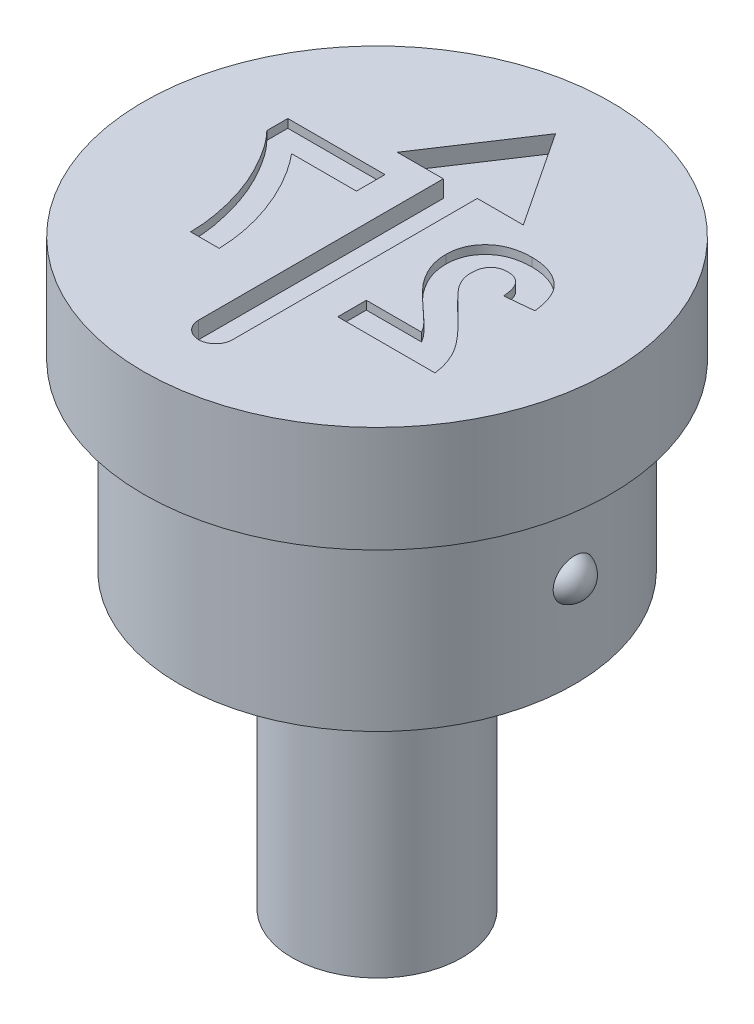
from build123d import *

# Parameters (mm, degrees)
CUT_EXTRUDE1_DEPTH = 0.4
CUT_EXTRUDE2_DEPTH = 0.2


with BuildPart() as part:
    # Sketch1 → Revolve1 (revolve)
    with BuildSketch(Plane.XY, mode=Mode.PRIVATE) as revolve1_sk:
        Polygon((0, 0), (-5.5, 0), (-5.5, -2.5), (-4.65, -2.5), (-4.65, -6.8), (-2, -6.8), (-2, -13.7), (0, -13.7), align=None)
    revolve(revolve1_sk.sketch.rotate(Axis((0, 0, 0), (0, -1, 0)), 270), axis=Axis((0, 0, 0), (0, -1, 0)))

    # Sketch3 → Cut-Extrude1 (cut)
    with BuildSketch(Plane(origin=(0, 0, 0), x_dir=(1, 0, 0), z_dir=(0, 1, 0))):
        with BuildLine():
            Line((0, 4.2), (-1.482623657, 1.96))
            Line((-1.482623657, 1.96), (-0.4, 1.96))
            Line((-0.4, 1.96), (-0.4, -3.8))
            ThreePointArc((-0.4, -3.8), (0, -4.2), (0.4, -3.8))
            Line((0.4, -3.8), (0.4, 1.96))
            Line((0.4, 1.96), (1.482623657, 1.96))
            Line((1.482623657, 1.96), (0, 4.2))
        make_face()
    extrude(amount=-CUT_EXTRUDE1_DEPTH, mode=Mode.SUBTRACT)

    # Sketch4 → Cut-Extrude2 (cut)
    with BuildSketch(Plane(origin=(0, 0, 0), x_dir=(1, 0, 0), z_dir=(0, 1, 0))):
        with BuildLine():
            Line((1.170081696, -1.422594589), (1.170081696, -2.095671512))
            Line((1.170081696, -2.095671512), (3.458543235, -2.095671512))
            add(Edge.make_bspline(
                [(3.458543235, -2.095671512), (3.450795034, -2.038147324), (3.435302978, -1.923131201), (3.387407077, -1.755121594), (3.323482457, -1.591172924), (3.254104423, -1.457758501), (3.185100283, -1.350364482), (3.122492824, -1.262364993), (3.047804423, -1.168737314), (2.962118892, -1.068725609), (2.865909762, -0.962017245), (2.758459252, -0.849008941), (2.639254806, -0.730241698), (2.555392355, -0.649592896), (2.512028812, -0.607891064)],
                knots=[0, 0, 0, 0, 1.156289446, 2.311930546, 3.473459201, 4.661751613, 5.303057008, 6.018253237, 6.81459331, 7.690699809, 8.644447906, 9.679642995, 10.800191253, 12, 12, 12, 12], degree=3))
            add(Edge.make_bspline(
                [(2.512028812, -0.607891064), (2.477424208, -0.574488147), (2.411547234, -0.510898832), (2.317738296, -0.41984151), (2.235270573, -0.336133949), (2.162419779, -0.261945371), (2.10086887, -0.195386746), (2.049808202, -0.137503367), (2.008591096, -0.088059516), (1.986267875, -0.056692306), (1.97637176, -0.042786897)],
                knots=[0, 0, 0, 0, 1.480720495, 2.818855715, 4.024636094, 5.098235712, 6.019786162, 6.815086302, 7.474715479, 8, 8, 8, 8], degree=3))
            add(Edge.make_bspline(
                [(1.97637176, -0.042786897), (1.956106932, -0.009124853), (1.917018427, 0.05580533), (1.874154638, 0.157909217), (1.848426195, 0.259992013), (1.844895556, 0.328203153), (1.843158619, 0.361760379)],
                knots=[0, 0, 0, 0, 1.0911822, 2.104764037, 3.067617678, 4, 4, 4, 4], degree=3))
            add(Edge.make_bspline(
                [(1.843158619, 0.361760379), (1.844419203, 0.396681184), (1.846804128, 0.462748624), (1.866802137, 0.555981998), (1.902265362, 0.636129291), (1.951091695, 0.703436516), (2.012832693, 0.756171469), (2.085009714, 0.795137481), (2.168679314, 0.816680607), (2.227487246, 0.8195142), (2.258222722, 0.820995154)],
                knots=[0, 0, 0, 0, 1.193122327, 2.257294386, 3.237245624, 4.168877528, 5.075331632, 5.990371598, 6.949684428, 8, 8, 8, 8], degree=3))
            add(Edge.make_bspline(
                [(2.258222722, 0.820995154), (2.288750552, 0.819612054), (2.347723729, 0.816940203), (2.431537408, 0.793599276), (2.504858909, 0.753193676), (2.55711171, 0.707147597), (2.592410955, 0.66237113), (2.61646263, 0.623351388), (2.637193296, 0.579012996), (2.655562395, 0.529855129), (2.670071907, 0.475314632), (2.681756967, 0.415806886), (2.691173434, 0.351011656), (2.694168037, 0.305935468), (2.695722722, 0.282533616)],
                knots=[0, 0, 0, 0, 1.402788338, 2.709884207, 3.961032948, 5.225417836, 5.883680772, 6.578928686, 7.329201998, 8.132101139, 8.990263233, 9.922304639, 10.921339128, 12, 12, 12, 12], degree=3))
            Line((2.695722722, 0.282533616), (3.368799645, 0.348439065))
            add(Edge.make_bspline(
                [(3.368799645, 0.348439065), (3.363388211, 0.393880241), (3.352896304, 0.48198342), (3.326713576, 0.608529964), (3.293554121, 0.725274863), (3.251837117, 0.832001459), (3.203286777, 0.929388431), (3.14542663, 1.015974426), (3.080278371, 1.092718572), (3.007785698, 1.159580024), (2.928409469, 1.216771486), (2.84511836, 1.267823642), (2.756284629, 1.309702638), (2.662886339, 1.344217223), (2.564965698, 1.371801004), (2.462069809, 1.390039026), (2.354833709, 1.40286772), (2.281633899, 1.403834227), (2.244200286, 1.404328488)],
                knots=[0, 0, 0, 0, 1.270971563, 2.464210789, 3.586263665, 4.638946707, 5.643716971, 6.603612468, 7.52484387, 8.434700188, 9.336036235, 10.239171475, 11.145359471, 12.059630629, 13.003312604, 13.96741569, 14.960557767, 16, 16, 16, 16], degree=3))
            add(Edge.make_bspline(
                [(2.244200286, 1.404328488), (2.203505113, 1.403546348), (2.124246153, 1.402023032), (2.008542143, 1.389443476), (1.899846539, 1.367509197), (1.797209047, 1.338454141), (1.7016837, 1.299663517), (1.612474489, 1.252767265), (1.53098541, 1.195985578), (1.456001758, 1.132415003), (1.388972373, 1.062507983), (1.330260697, 0.987940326), (1.281072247, 0.908763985), (1.239795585, 0.825944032), (1.209147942, 0.738147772), (1.186816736, 0.646589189), (1.172010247, 0.550841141), (1.170731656, 0.485447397), (1.170081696, 0.45220509)],
                knots=[0, 0, 0, 0, 1.210756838, 2.35810096, 3.457354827, 4.507168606, 5.527358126, 6.519769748, 7.499700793, 8.476517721, 9.440526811, 10.376769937, 11.295256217, 12.209626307, 13.124630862, 14.055668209, 15.011616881, 16, 16, 16, 16], degree=3))
            add(Edge.make_bspline(
                [(1.170081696, 0.45220509), (1.17093801, 0.414053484), (1.172636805, 0.338366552), (1.188901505, 0.226478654), (1.2137508, 0.117170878), (1.250476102, 0.010176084), (1.297028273, -0.097072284), (1.357035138, -0.204814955), (1.426707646, -0.316301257), (1.481258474, -0.388382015), (1.509424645, -0.425599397)],
                knots=[0, 0, 0, 0, 0.953409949, 1.89141903, 2.821310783, 3.752688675, 4.715703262, 5.740811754, 6.833515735, 8, 8, 8, 8], degree=3))
            add(Edge.make_bspline(
                [(1.509424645, -0.425599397), (1.520070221, -0.439007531), (1.542870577, -0.467724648), (1.581659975, -0.511757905), (1.626613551, -0.559856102), (1.677096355, -0.612919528), (1.734775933, -0.66906906), (1.797576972, -0.730652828), (1.868262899, -0.79452062), (1.94147639, -0.862265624), (2.015008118, -0.928200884), (2.082594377, -0.990824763), (2.143985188, -1.046233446), (2.196321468, -1.097485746), (2.242681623, -1.141083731), (2.281394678, -1.179263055), (2.313185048, -1.211099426), (2.356990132, -1.260724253), (2.41272713, -1.327841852), (2.451940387, -1.391974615), (2.470662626, -1.422594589)],
                knots=[0, 0, 0, 0, 0.665555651, 1.425465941, 2.280616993, 3.225313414, 4.272635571, 5.410053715, 6.644756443, 7.976022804, 9.288331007, 10.484517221, 11.558462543, 12.503158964, 13.33222979, 14.032602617, 14.617328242, 15.080653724, 16.606167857, 18, 18, 18, 18], degree=3))
            Line((2.470662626, -1.422594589), (1.170081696, -1.422594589))
        make_face()
        with BuildLine():
            Line((-1.172225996, 0.68637977), (-1.172225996, 1.359456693))
            Line((-1.172225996, 1.359456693), (-3.460687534, 1.359456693))
            Line((-3.460687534, 1.359456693), (-3.460687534, 0.865866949))
            add(Edge.make_bspline(
                [(-3.460687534, 0.865866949), (-3.436814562, 0.841576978), (-3.387738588, 0.791643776), (-3.317442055, 0.709923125), (-3.246103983, 0.621241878), (-3.175216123, 0.524405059), (-3.102574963, 0.420942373), (-3.031372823, 0.308870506), (-2.959157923, 0.189643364), (-2.861933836, 0.020996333), (-2.748291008, -0.199308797), (-2.628062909, -0.473159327), (-2.525634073, -0.755420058), (-2.455495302, -0.995927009), (-2.408105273, -1.18869296), (-2.377142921, -1.329647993), (-2.351079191, -1.466636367), (-2.329876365, -1.599898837), (-2.314052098, -1.729496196), (-2.301548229, -1.854977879), (-2.295379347, -1.976649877), (-2.294469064, -2.056403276), (-2.294020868, -2.095671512)],
                knots=[0, 0, 0, 0, 0.628545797, 1.29210959, 1.98878689, 2.729126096, 3.507039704, 4.322017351, 5.179550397, 6.080149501, 7.915136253, 9.752312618, 11.597470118, 13.454141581, 14.373891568, 15.261584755, 16.117868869, 16.947726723, 17.752002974, 18.527724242, 19.275094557, 20, 20, 20, 20], degree=3))
            Line((-2.294020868, -2.095671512), (-1.620943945, -2.095671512))
            add(Edge.make_bspline(
                [(-1.620943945, -2.095671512), (-1.623194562, -2.036044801), (-1.627720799, -1.91612897), (-1.64465549, -1.736139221), (-1.671253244, -1.555479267), (-1.70428944, -1.373731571), (-1.747905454, -1.191338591), (-1.797684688, -1.007624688), (-1.857984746, -0.823571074), (-1.925579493, -0.639529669), (-2.00020054, -0.4572478), (-2.081526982, -0.278986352), (-2.169348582, -0.105857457), (-2.262523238, 0.062747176), (-2.362134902, 0.226285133), (-2.468258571, 0.384578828), (-2.579388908, 0.538773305), (-2.658848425, 0.637185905), (-2.698568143, 0.68637977)],
                knots=[0, 0, 0, 0, 0.943249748, 1.896978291, 2.856365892, 3.829648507, 4.816416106, 5.820376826, 6.838120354, 7.877341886, 8.919613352, 9.951365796, 10.974227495, 11.988073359, 12.996274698, 14.000568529, 15.000536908, 16, 16, 16, 16], degree=3))
            Line((-2.698568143, 0.68637977), (-1.172225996, 0.68637977))
        make_face()
    extrude(amount=-CUT_EXTRUDE2_DEPTH, mode=Mode.SUBTRACT)

    # Sketch5 → Revolve2 (revolve)
    with BuildSketch(Plane.XY):
        with BuildLine():
            Line((4.483293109, -4.15), (4.483293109, -5.15))
            ThreePointArc((4.483293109, -5.15), (4.983293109, -4.65), (4.483293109, -4.15))
        make_face()
    revolve(axis=Axis((4.483293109, -4.15, 0), (0, -1, 0)))


solid = part.part
